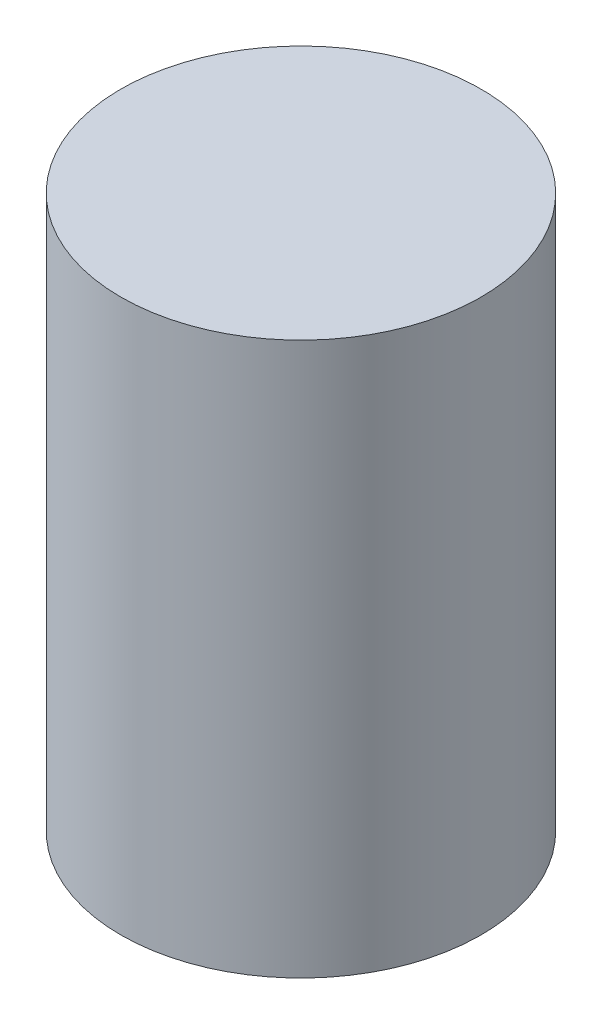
ISO-10303-21;
HEADER;
FILE_DESCRIPTION(('STEP AP214'),'2;1');
FILE_NAME('part.step','',(''),(''),'','','');
FILE_SCHEMA(('AUTOMOTIVE_DESIGN { 1 0 10303 214 1 1 1 1 }'));
ENDSEC;
DATA;
#1=APPLICATION_CONTEXT('core data for automotive mechanical design processes');
#2=APPLICATION_PROTOCOL_DEFINITION('international standard','automotive_design',2000,#1);
#3=PRODUCT_CONTEXT('',#1,'mechanical');
#4=PRODUCT('Part','Part','',(#3));
#5=PRODUCT_RELATED_PRODUCT_CATEGORY('part','',(#4));
#6=PRODUCT_DEFINITION_FORMATION('','',#4);
#7=PRODUCT_DEFINITION_CONTEXT('part definition',#1,'design');
#8=PRODUCT_DEFINITION('design','',#6,#7);
#9=PRODUCT_DEFINITION_SHAPE('','',#8);
#10=(LENGTH_UNIT() NAMED_UNIT(*) SI_UNIT(.MILLI.,.METRE.));
#11=(NAMED_UNIT(*) PLANE_ANGLE_UNIT() SI_UNIT($,.RADIAN.));
#12=(NAMED_UNIT(*) SI_UNIT($,.STERADIAN.) SOLID_ANGLE_UNIT());
#13=UNCERTAINTY_MEASURE_WITH_UNIT(LENGTH_MEASURE(1.E-05),#10,'distance_accuracy_value','');
#14=(GEOMETRIC_REPRESENTATION_CONTEXT(3) GLOBAL_UNCERTAINTY_ASSIGNED_CONTEXT((#13)) GLOBAL_UNIT_ASSIGNED_CONTEXT((#10,
#11,#12)) REPRESENTATION_CONTEXT('',''));
#15=CARTESIAN_POINT('',(0.,0.,0.));
#16=DIRECTION('',(0.,0.,1.));
#17=DIRECTION('',(1.,0.,0.));
#18=AXIS2_PLACEMENT_3D('',#15,#16,#17);
#19=CARTESIAN_POINT('',(0.,11.5,0.));
#20=DIRECTION('',(0.,-1.,0.));
#21=DIRECTION('',(0.,0.,-1.));
#22=AXIS2_PLACEMENT_3D('',#19,#20,#21);
#23=CYLINDRICAL_SURFACE('',#22,3.75);
#24=CARTESIAN_POINT('',(0.,11.5,0.));
#25=DIRECTION('',(0.,1.,0.));
#26=DIRECTION('',(0.,0.,1.));
#27=AXIS2_PLACEMENT_3D('',#24,#25,#26);
#28=CIRCLE('',#27,3.75);
#29=CARTESIAN_POINT('',(0.,11.5,3.75));
#30=VERTEX_POINT('',#29);
#31=EDGE_CURVE('E10',#30,#30,#28,.T.);
#32=ORIENTED_EDGE('',*,*,#31,.F.);
#33=EDGE_LOOP('',(#32));
#34=FACE_BOUND('',#33,.T.);
#35=CARTESIAN_POINT('',(0.,0.,0.));
#36=DIRECTION('',(0.,1.,0.));
#37=DIRECTION('',(0.,0.,1.));
#38=AXIS2_PLACEMENT_3D('',#35,#36,#37);
#39=CIRCLE('',#38,3.75);
#40=CARTESIAN_POINT('',(0.,0.,3.75));
#41=VERTEX_POINT('',#40);
#42=EDGE_CURVE('E34',#41,#41,#39,.T.);
#43=ORIENTED_EDGE('',*,*,#42,.T.);
#44=EDGE_LOOP('',(#43));
#45=FACE_BOUND('',#44,.T.);
#46=ADVANCED_FACE('F31',(#34,#45),#23,.T.);
#47=CARTESIAN_POINT('',(0.,11.5,0.));
#48=DIRECTION('',(0.,1.,0.));
#49=DIRECTION('',(0.,0.,1.));
#50=AXIS2_PLACEMENT_3D('',#47,#48,#49);
#51=PLANE('',#50);
#52=ORIENTED_EDGE('',*,*,#31,.T.);
#53=EDGE_LOOP('',(#52));
#54=FACE_BOUND('',#53,.T.);
#55=ADVANCED_FACE('F46',(#54),#51,.T.);
#56=CARTESIAN_POINT('',(0.,0.,0.));
#57=DIRECTION('',(0.,1.,0.));
#58=DIRECTION('',(0.,0.,1.));
#59=AXIS2_PLACEMENT_3D('',#56,#57,#58);
#60=PLANE('',#59);
#61=ORIENTED_EDGE('',*,*,#42,.F.);
#62=EDGE_LOOP('',(#61));
#63=FACE_BOUND('',#62,.T.);
#64=ADVANCED_FACE('F44',(#63),#60,.F.);
#65=CLOSED_SHELL('',(#46,#55,#64));
#66=MANIFOLD_SOLID_BREP('B2',#65);
#67=ADVANCED_BREP_SHAPE_REPRESENTATION('',(#18,#66),#14);
#68=SHAPE_DEFINITION_REPRESENTATION(#9,#67);
ENDSEC;
END-ISO-10303-21;
